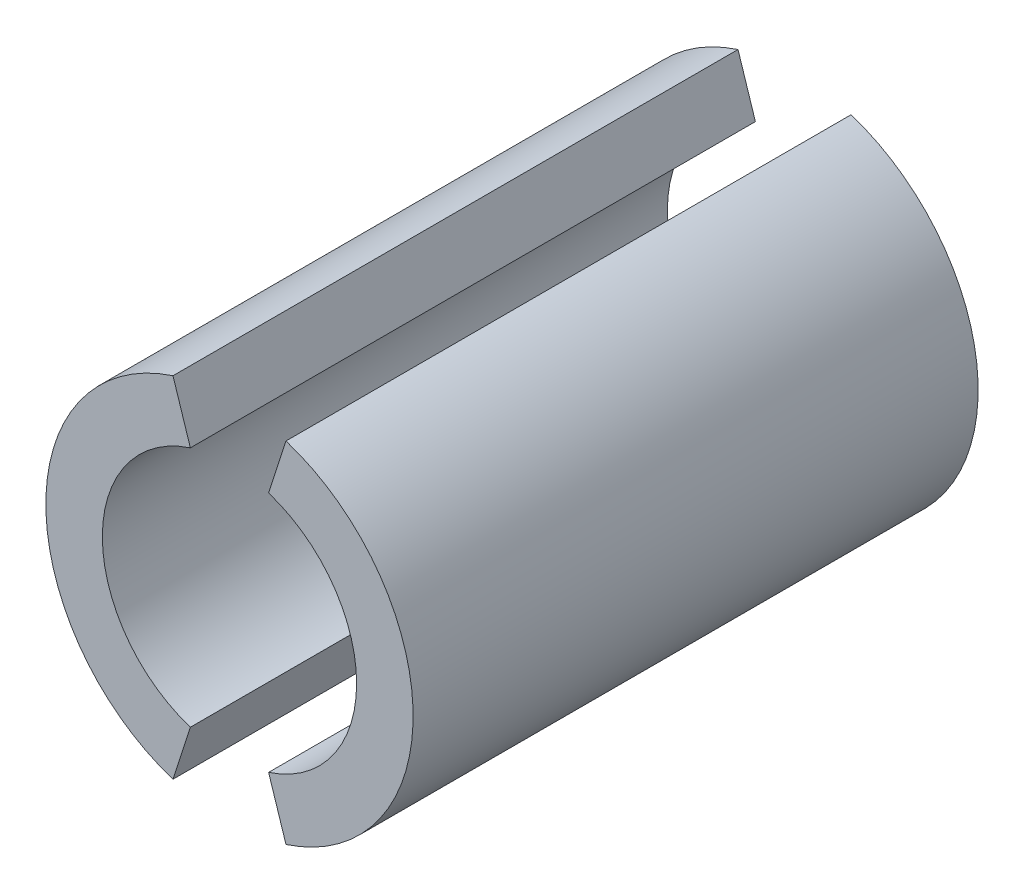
from build123d import *

# Parameters (mm, degrees)
EXTRUDE1_DEPTH        = 31.75
EXTRUDE1_DEPTH_BACK   = 31.75
EXTRUDE1_2_DEPTH      = 31.75
EXTRUDE1_2_DEPTH_BACK = 31.75


with BuildPart() as part:
    # Sketch1 → Extrude1 (new, two sides: drawn at the far end of the back side and taken through both)
    with BuildSketch(Plane.XY.offset(-EXTRUDE1_DEPTH_BACK)):
        with BuildLine():
            Line((-6.35, 19.636290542), (-4.396153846, 13.594354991))
            ThreePointArc((-4.396153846, 13.594354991), (-14.2875, 0), (-4.396153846, -13.594354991))
            Line((-4.396153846, -13.594354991), (-6.35, -19.636290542))
            ThreePointArc((-6.35, -19.636290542), (-20.6375, 0), (-6.35, 19.636290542))
        make_face()
    extrude(amount=EXTRUDE1_DEPTH + EXTRUDE1_DEPTH_BACK)


with BuildPart() as body_2:
    # Sketch1 → Extrude1 2 (new, two sides: drawn at the far end of the back side and taken through both)
    with BuildSketch(Plane.XY.offset(-EXTRUDE1_2_DEPTH_BACK)):
        with BuildLine():
            Line((4.396153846, -13.594354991), (6.35, -19.636290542))
            ThreePointArc((6.35, -19.636290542), (20.6375, 0), (6.35, 19.636290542))
            Line((6.35, 19.636290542), (4.396153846, 13.594354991))
            ThreePointArc((4.396153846, 13.594354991), (14.2875, 0), (4.396153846, -13.594354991))
        make_face()
    extrude(amount=EXTRUDE1_2_DEPTH + EXTRUDE1_2_DEPTH_BACK)


solid = Compound([part.part, body_2.part])
